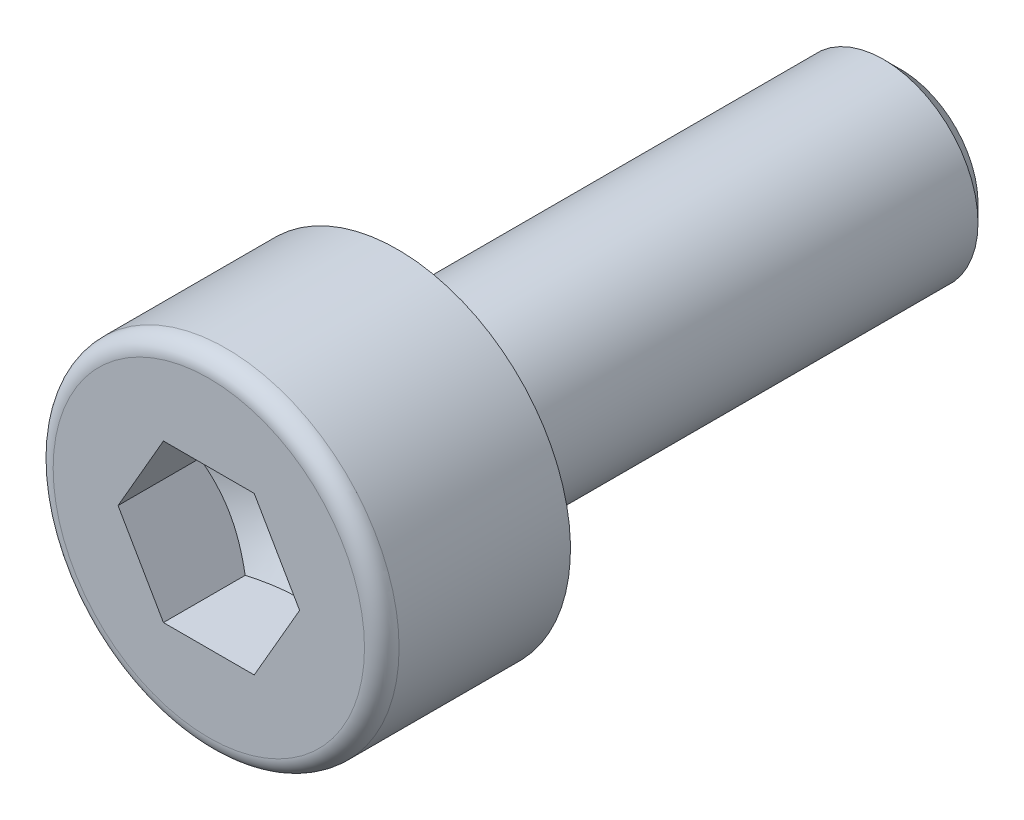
ISO-10303-21;
HEADER;
FILE_DESCRIPTION(('STEP AP214'),'2;1');
FILE_NAME('part.step','',(''),(''),'','','');
FILE_SCHEMA(('AUTOMOTIVE_DESIGN { 1 0 10303 214 1 1 1 1 }'));
ENDSEC;
DATA;
#1=APPLICATION_CONTEXT('core data for automotive mechanical design processes');
#2=APPLICATION_PROTOCOL_DEFINITION('international standard','automotive_design',2000,#1);
#3=PRODUCT_CONTEXT('',#1,'mechanical');
#4=PRODUCT('Part','Part','',(#3));
#5=PRODUCT_RELATED_PRODUCT_CATEGORY('part','',(#4));
#6=PRODUCT_DEFINITION_FORMATION('','',#4);
#7=PRODUCT_DEFINITION_CONTEXT('part definition',#1,'design');
#8=PRODUCT_DEFINITION('design','',#6,#7);
#9=PRODUCT_DEFINITION_SHAPE('','',#8);
#10=(LENGTH_UNIT() NAMED_UNIT(*) SI_UNIT(.MILLI.,.METRE.));
#11=(NAMED_UNIT(*) PLANE_ANGLE_UNIT() SI_UNIT($,.RADIAN.));
#12=(NAMED_UNIT(*) SI_UNIT($,.STERADIAN.) SOLID_ANGLE_UNIT());
#13=UNCERTAINTY_MEASURE_WITH_UNIT(LENGTH_MEASURE(1.E-05),#10,'distance_accuracy_value','');
#14=(GEOMETRIC_REPRESENTATION_CONTEXT(3) GLOBAL_UNCERTAINTY_ASSIGNED_CONTEXT((#13)) GLOBAL_UNIT_ASSIGNED_CONTEXT((#10,
#11,#12)) REPRESENTATION_CONTEXT('',''));
#15=CARTESIAN_POINT('',(0.,0.,0.));
#16=DIRECTION('',(0.,0.,1.));
#17=DIRECTION('',(1.,0.,0.));
#18=AXIS2_PLACEMENT_3D('',#15,#16,#17);
#19=CARTESIAN_POINT('',(0.,1.2375,3.));
#20=DIRECTION('',(0.,0.,1.));
#21=DIRECTION('',(1.,0.,0.));
#22=AXIS2_PLACEMENT_3D('',#19,#20,#21);
#23=PLANE('',#22);
#24=DIRECTION('',(-0.5,0.866025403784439,0.));
#25=VECTOR('',#24,1.);
#26=CARTESIAN_POINT('',(-1.35045785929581,-0.160937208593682,3.));
#27=LINE('',#26,#25);
#28=CARTESIAN_POINT('',(-0.7216875,-1.24999941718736,3.));
#29=VERTEX_POINT('',#28);
#30=CARTESIAN_POINT('',(-1.443375,0.,3.));
#31=VERTEX_POINT('',#30);
#32=EDGE_CURVE('E192',#29,#31,#27,.T.);
#33=ORIENTED_EDGE('',*,*,#32,.T.);
#34=DIRECTION('',(0.5,0.866025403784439,0.));
#35=VECTOR('',#34,1.);
#36=CARTESIAN_POINT('',(-0.81460464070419,1.08906220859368,3.));
#37=LINE('',#36,#35);
#38=CARTESIAN_POINT('',(-0.7216875,1.24999941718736,3.));
#39=VERTEX_POINT('',#38);
#40=EDGE_CURVE('E10',#31,#39,#37,.T.);
#41=ORIENTED_EDGE('',*,*,#40,.T.);
#42=DIRECTION('',(1.,0.,0.));
#43=VECTOR('',#42,1.);
#44=CARTESIAN_POINT('',(0.,1.24999941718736,3.));
#45=LINE('',#44,#43);
#46=CARTESIAN_POINT('',(0.7216875,1.24999941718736,3.));
#47=VERTEX_POINT('',#46);
#48=EDGE_CURVE('E127',#39,#47,#45,.T.);
#49=ORIENTED_EDGE('',*,*,#48,.T.);
#50=DIRECTION('',(0.5,-0.866025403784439,0.));
#51=VECTOR('',#50,1.);
#52=CARTESIAN_POINT('',(0.814604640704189,1.08906220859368,3.));
#53=LINE('',#52,#51);
#54=CARTESIAN_POINT('',(1.443375,0.,3.));
#55=VERTEX_POINT('',#54);
#56=EDGE_CURVE('E185',#47,#55,#53,.T.);
#57=ORIENTED_EDGE('',*,*,#56,.T.);
#58=DIRECTION('',(-0.5,-0.866025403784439,0.));
#59=VECTOR('',#58,1.);
#60=CARTESIAN_POINT('',(1.35045785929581,-0.160937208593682,3.));
#61=LINE('',#60,#59);
#62=CARTESIAN_POINT('',(0.7216875,-1.24999941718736,3.));
#63=VERTEX_POINT('',#62);
#64=EDGE_CURVE('E189',#55,#63,#61,.T.);
#65=ORIENTED_EDGE('',*,*,#64,.T.);
#66=DIRECTION('',(-1.,0.,0.));
#67=VECTOR('',#66,1.);
#68=CARTESIAN_POINT('',(0.,-1.24999941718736,3.));
#69=LINE('',#68,#67);
#70=EDGE_CURVE('E158',#63,#29,#69,.T.);
#71=ORIENTED_EDGE('',*,*,#70,.T.);
#72=EDGE_LOOP('',(#33,#41,#49,#57,#65,#71));
#73=FACE_BOUND('',#72,.T.);
#74=CARTESIAN_POINT('',(0.,0.,3.));
#75=DIRECTION('',(0.,0.,-1.));
#76=DIRECTION('',(0.,1.,0.));
#77=AXIS2_PLACEMENT_3D('',#74,#75,#76);
#78=CIRCLE('',#77,2.475);
#79=CARTESIAN_POINT('',(2.475,0.,3.));
#80=VERTEX_POINT('',#79);
#81=EDGE_CURVE('E150',#80,#80,#78,.T.);
#82=ORIENTED_EDGE('',*,*,#81,.F.);
#83=EDGE_LOOP('',(#82));
#84=FACE_BOUND('',#83,.T.);
#85=ADVANCED_FACE('F16',(#73,#84),#23,.T.);
#86=CARTESIAN_POINT('',(0.,0.6146875,-8.));
#87=DIRECTION('',(0.,0.,-1.));
#88=DIRECTION('',(0.,-1.,0.));
#89=AXIS2_PLACEMENT_3D('',#86,#87,#88);
#90=PLANE('',#89);
#91=CARTESIAN_POINT('',(0.,0.,-8.));
#92=DIRECTION('',(0.,0.,-1.));
#93=DIRECTION('',(0.,1.,0.));
#94=AXIS2_PLACEMENT_3D('',#91,#92,#93);
#95=CIRCLE('',#94,1.229375);
#96=CARTESIAN_POINT('',(0.,-1.229375,-8.));
#97=VERTEX_POINT('',#96);
#98=EDGE_CURVE('E223',#97,#97,#95,.T.);
#99=ORIENTED_EDGE('',*,*,#98,.T.);
#100=EDGE_LOOP('',(#99));
#101=FACE_BOUND('',#100,.T.);
#102=ADVANCED_FACE('F273',(#101),#90,.T.);
#103=CARTESIAN_POINT('',(0.,2.2,0.));
#104=DIRECTION('',(0.,0.,-1.));
#105=DIRECTION('',(0.,-1.,0.));
#106=AXIS2_PLACEMENT_3D('',#103,#104,#105);
#107=PLANE('',#106);
#108=CARTESIAN_POINT('',(0.,0.,0.));
#109=DIRECTION('',(0.,0.,-1.));
#110=DIRECTION('',(0.,1.,0.));
#111=AXIS2_PLACEMENT_3D('',#108,#109,#110);
#112=CIRCLE('',#111,1.65);
#113=CARTESIAN_POINT('',(0.,1.65,0.));
#114=VERTEX_POINT('',#113);
#115=EDGE_CURVE('E156',#114,#114,#112,.T.);
#116=ORIENTED_EDGE('',*,*,#115,.F.);
#117=EDGE_LOOP('',(#116));
#118=FACE_BOUND('',#117,.T.);
#119=CARTESIAN_POINT('',(0.,0.,0.));
#120=DIRECTION('',(0.,0.,-1.));
#121=DIRECTION('',(0.,1.,0.));
#122=AXIS2_PLACEMENT_3D('',#119,#120,#121);
#123=CIRCLE('',#122,2.75);
#124=CARTESIAN_POINT('',(0.,-2.75,0.));
#125=VERTEX_POINT('',#124);
#126=EDGE_CURVE('E225',#125,#125,#123,.T.);
#127=ORIENTED_EDGE('',*,*,#126,.T.);
#128=EDGE_LOOP('',(#127));
#129=FACE_BOUND('',#128,.T.);
#130=ADVANCED_FACE('F277',(#118,#129),#107,.T.);
#131=CARTESIAN_POINT('',(-1.08253125,0.624999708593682,3.));
#132=DIRECTION('',(-0.866025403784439,0.5,0.));
#133=DIRECTION('',(0.,0.,1.));
#134=AXIS2_PLACEMENT_3D('',#131,#132,#133);
#135=PLANE('',#134);
#136=CARTESIAN_POINT('',(-1.443375,0.,1.7));
#137=CARTESIAN_POINT('',(-1.08253125,0.624999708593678,1.49166676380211));
#138=CARTESIAN_POINT('',(-0.7216875,1.24999941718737,1.7));
#139=(BOUNDED_CURVE() B_SPLINE_CURVE(2,(#136,#137,#138),.UNSPECIFIED.,.F.,
.F.) B_SPLINE_CURVE_WITH_KNOTS((3,3),(0.,1.46054449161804),
.UNSPECIFIED.) CURVE() GEOMETRIC_REPRESENTATION_ITEM() RATIONAL_B_SPLINE_CURVE((1.,
1.15470053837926,1.)) REPRESENTATION_ITEM(''));
#140=CARTESIAN_POINT('',(-1.443375,0.,1.7));
#141=VERTEX_POINT('',#140);
#142=CARTESIAN_POINT('',(-0.7216875,1.24999941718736,1.7));
#143=VERTEX_POINT('',#142);
#144=EDGE_CURVE('E132',#141,#143,#139,.T.);
#145=ORIENTED_EDGE('',*,*,#144,.T.);
#146=DIRECTION('',(0.,0.,-1.));
#147=VECTOR('',#146,1.);
#148=CARTESIAN_POINT('',(-0.7216875,1.24999941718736,3.));
#149=LINE('',#148,#147);
#150=EDGE_CURVE('E29',#39,#143,#149,.T.);
#151=ORIENTED_EDGE('',*,*,#150,.F.);
#152=ORIENTED_EDGE('',*,*,#40,.F.);
#153=DIRECTION('',(0.,0.,-1.));
#154=VECTOR('',#153,1.);
#155=CARTESIAN_POINT('',(-1.443375,0.,3.));
#156=LINE('',#155,#154);
#157=EDGE_CURVE('E134',#31,#141,#156,.T.);
#158=ORIENTED_EDGE('',*,*,#157,.T.);
#159=EDGE_LOOP('',(#145,#151,#152,#158));
#160=FACE_BOUND('',#159,.T.);
#161=ADVANCED_FACE('F18',(#160),#135,.F.);
#162=CARTESIAN_POINT('',(0.,1.24999941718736,3.));
#163=DIRECTION('',(0.,1.,0.));
#164=DIRECTION('',(1.,0.,0.));
#165=AXIS2_PLACEMENT_3D('',#162,#163,#164);
#166=PLANE('',#165);
#167=CARTESIAN_POINT('',(-0.7216875,1.24999941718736,1.7));
#168=CARTESIAN_POINT('',(-0.334936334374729,1.24999941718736,1.58835455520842));
#169=CARTESIAN_POINT('',(0.,1.24999941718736,1.58835455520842));
#170=(BOUNDED_CURVE() B_SPLINE_CURVE(2,(#167,#168,#169),.UNSPECIFIED.,.F.,
.F.) B_SPLINE_CURVE_WITH_KNOTS((3,3),(0.,0.730272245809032),
.UNSPECIFIED.) CURVE() GEOMETRIC_REPRESENTATION_ITEM() RATIONAL_B_SPLINE_CURVE((1.,
1.07735026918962,1.07735026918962)) REPRESENTATION_ITEM(''));
#171=CARTESIAN_POINT('',(0.,1.24999941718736,1.58835455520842));
#172=VERTEX_POINT('',#171);
#173=EDGE_CURVE('E124',#143,#172,#170,.T.);
#174=ORIENTED_EDGE('',*,*,#173,.T.);
#175=CARTESIAN_POINT('',(0.,1.24999941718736,1.58835455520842));
#176=CARTESIAN_POINT('',(0.33493633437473,1.24999941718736,1.58835455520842));
#177=CARTESIAN_POINT('',(0.7216875,1.24999941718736,1.7));
#178=(BOUNDED_CURVE() B_SPLINE_CURVE(2,(#175,#176,#177),.UNSPECIFIED.,.F.,
.F.) B_SPLINE_CURVE_WITH_KNOTS((3,3),(0.730272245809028,1.46054449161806),
.UNSPECIFIED.) CURVE() GEOMETRIC_REPRESENTATION_ITEM() RATIONAL_B_SPLINE_CURVE((1.07735026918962,
1.07735026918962,1.)) REPRESENTATION_ITEM(''));
#179=CARTESIAN_POINT('',(0.7216875,1.24999941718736,1.7));
#180=VERTEX_POINT('',#179);
#181=EDGE_CURVE('E143',#172,#180,#178,.T.);
#182=ORIENTED_EDGE('',*,*,#181,.T.);
#183=DIRECTION('',(0.,0.,-1.));
#184=VECTOR('',#183,1.);
#185=CARTESIAN_POINT('',(0.7216875,1.24999941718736,3.));
#186=LINE('',#185,#184);
#187=EDGE_CURVE('E166',#47,#180,#186,.T.);
#188=ORIENTED_EDGE('',*,*,#187,.F.);
#189=ORIENTED_EDGE('',*,*,#48,.F.);
#190=ORIENTED_EDGE('',*,*,#150,.T.);
#191=EDGE_LOOP('',(#174,#182,#188,#189,#190));
#192=FACE_BOUND('',#191,.T.);
#193=ADVANCED_FACE('F121',(#192),#166,.F.);
#194=CARTESIAN_POINT('',(1.08253125,0.624999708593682,3.));
#195=DIRECTION('',(0.866025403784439,0.5,0.));
#196=DIRECTION('',(0.,0.,-1.));
#197=AXIS2_PLACEMENT_3D('',#194,#195,#196);
#198=PLANE('',#197);
#199=CARTESIAN_POINT('',(0.7216875,1.24999941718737,1.7));
#200=CARTESIAN_POINT('',(1.08253125,0.624999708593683,1.49166676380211));
#201=CARTESIAN_POINT('',(1.443375,0.,1.7));
#202=(BOUNDED_CURVE() B_SPLINE_CURVE(2,(#199,#200,#201),.UNSPECIFIED.,.F.,
.F.) B_SPLINE_CURVE_WITH_KNOTS((3,3),(0.,1.46054449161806),
.UNSPECIFIED.) CURVE() GEOMETRIC_REPRESENTATION_ITEM() RATIONAL_B_SPLINE_CURVE((1.,
1.15470053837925,1.)) REPRESENTATION_ITEM(''));
#203=CARTESIAN_POINT('',(1.443375,0.,1.7));
#204=VERTEX_POINT('',#203);
#205=EDGE_CURVE('E179',#180,#204,#202,.T.);
#206=ORIENTED_EDGE('',*,*,#205,.T.);
#207=DIRECTION('',(0.,0.,-1.));
#208=VECTOR('',#207,1.);
#209=CARTESIAN_POINT('',(1.443375,0.,3.));
#210=LINE('',#209,#208);
#211=EDGE_CURVE('E198',#55,#204,#210,.T.);
#212=ORIENTED_EDGE('',*,*,#211,.F.);
#213=ORIENTED_EDGE('',*,*,#56,.F.);
#214=ORIENTED_EDGE('',*,*,#187,.T.);
#215=EDGE_LOOP('',(#206,#212,#213,#214));
#216=FACE_BOUND('',#215,.T.);
#217=ADVANCED_FACE('F244',(#216),#198,.F.);
#218=CARTESIAN_POINT('',(1.08253125,-0.624999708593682,3.));
#219=DIRECTION('',(0.866025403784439,-0.5,0.));
#220=DIRECTION('',(0.,0.,-1.));
#221=AXIS2_PLACEMENT_3D('',#218,#219,#220);
#222=PLANE('',#221);
#223=CARTESIAN_POINT('',(1.443375,0.,1.7));
#224=CARTESIAN_POINT('',(1.08253125,-0.624999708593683,1.49166676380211));
#225=CARTESIAN_POINT('',(0.7216875,-1.24999941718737,1.7));
#226=(BOUNDED_CURVE() B_SPLINE_CURVE(2,(#223,#224,#225),.UNSPECIFIED.,.F.,
.F.) B_SPLINE_CURVE_WITH_KNOTS((3,3),(0.,1.46054449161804),
.UNSPECIFIED.) CURVE() GEOMETRIC_REPRESENTATION_ITEM() RATIONAL_B_SPLINE_CURVE((1.,
1.15470053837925,1.)) REPRESENTATION_ITEM(''));
#227=CARTESIAN_POINT('',(0.7216875,-1.24999941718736,1.7));
#228=VERTEX_POINT('',#227);
#229=EDGE_CURVE('E170',#204,#228,#226,.T.);
#230=ORIENTED_EDGE('',*,*,#229,.T.);
#231=DIRECTION('',(0.,0.,-1.));
#232=VECTOR('',#231,1.);
#233=CARTESIAN_POINT('',(0.7216875,-1.24999941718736,3.));
#234=LINE('',#233,#232);
#235=EDGE_CURVE('E162',#63,#228,#234,.T.);
#236=ORIENTED_EDGE('',*,*,#235,.F.);
#237=ORIENTED_EDGE('',*,*,#64,.F.);
#238=ORIENTED_EDGE('',*,*,#211,.T.);
#239=EDGE_LOOP('',(#230,#236,#237,#238));
#240=FACE_BOUND('',#239,.T.);
#241=ADVANCED_FACE('F250',(#240),#222,.F.);
#242=CARTESIAN_POINT('',(0.,-1.24999941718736,3.));
#243=DIRECTION('',(0.,-1.,0.));
#244=DIRECTION('',(0.,0.,-1.));
#245=AXIS2_PLACEMENT_3D('',#242,#243,#244);
#246=PLANE('',#245);
#247=CARTESIAN_POINT('',(0.7216875,-1.24999941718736,1.7));
#248=CARTESIAN_POINT('',(0.33493633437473,-1.24999941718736,1.58835455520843));
#249=CARTESIAN_POINT('',(0.,-1.24999941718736,1.58835455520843));
#250=(BOUNDED_CURVE() B_SPLINE_CURVE(2,(#247,#248,#249),.UNSPECIFIED.,.F.,
.F.) B_SPLINE_CURVE_WITH_KNOTS((3,3),(0.,0.730272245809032),
.UNSPECIFIED.) CURVE() GEOMETRIC_REPRESENTATION_ITEM() RATIONAL_B_SPLINE_CURVE((1.,
1.07735026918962,1.07735026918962)) REPRESENTATION_ITEM(''));
#251=CARTESIAN_POINT('',(0.,-1.24999941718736,1.58835455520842));
#252=VERTEX_POINT('',#251);
#253=EDGE_CURVE('E20',#228,#252,#250,.T.);
#254=ORIENTED_EDGE('',*,*,#253,.T.);
#255=CARTESIAN_POINT('',(0.,-1.24999941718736,1.58835455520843));
#256=CARTESIAN_POINT('',(-0.33493633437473,-1.24999941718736,1.58835455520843));
#257=CARTESIAN_POINT('',(-0.7216875,-1.24999941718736,1.7));
#258=(BOUNDED_CURVE() B_SPLINE_CURVE(2,(#255,#256,#257),.UNSPECIFIED.,.F.,
.F.) B_SPLINE_CURVE_WITH_KNOTS((3,3),(0.730272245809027,1.46054449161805),
.UNSPECIFIED.) CURVE() GEOMETRIC_REPRESENTATION_ITEM() RATIONAL_B_SPLINE_CURVE((1.07735026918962,
1.07735026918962,1.)) REPRESENTATION_ITEM(''));
#259=CARTESIAN_POINT('',(-0.7216875,-1.24999941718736,1.7));
#260=VERTEX_POINT('',#259);
#261=EDGE_CURVE('E203',#252,#260,#258,.T.);
#262=ORIENTED_EDGE('',*,*,#261,.T.);
#263=DIRECTION('',(0.,0.,-1.));
#264=VECTOR('',#263,1.);
#265=CARTESIAN_POINT('',(-0.7216875,-1.24999941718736,3.));
#266=LINE('',#265,#264);
#267=EDGE_CURVE('E163',#29,#260,#266,.T.);
#268=ORIENTED_EDGE('',*,*,#267,.F.);
#269=ORIENTED_EDGE('',*,*,#70,.F.);
#270=ORIENTED_EDGE('',*,*,#235,.T.);
#271=EDGE_LOOP('',(#254,#262,#268,#269,#270));
#272=FACE_BOUND('',#271,.T.);
#273=ADVANCED_FACE('F254',(#272),#246,.F.);
#274=CARTESIAN_POINT('',(-1.08253125,-0.624999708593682,3.));
#275=DIRECTION('',(-0.866025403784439,-0.5,0.));
#276=DIRECTION('',(-0.5,0.866025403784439,0.));
#277=AXIS2_PLACEMENT_3D('',#274,#275,#276);
#278=PLANE('',#277);
#279=CARTESIAN_POINT('',(-0.7216875,-1.24999941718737,1.7));
#280=CARTESIAN_POINT('',(-1.08253125,-0.624999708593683,1.49166676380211));
#281=CARTESIAN_POINT('',(-1.443375,0.,1.7));
#282=(BOUNDED_CURVE() B_SPLINE_CURVE(2,(#279,#280,#281),.UNSPECIFIED.,.F.,
.F.) B_SPLINE_CURVE_WITH_KNOTS((3,3),(0.,1.46054449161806),
.UNSPECIFIED.) CURVE() GEOMETRIC_REPRESENTATION_ITEM() RATIONAL_B_SPLINE_CURVE((1.,
1.15470053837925,1.)) REPRESENTATION_ITEM(''));
#283=EDGE_CURVE('E139',#260,#141,#282,.T.);
#284=ORIENTED_EDGE('',*,*,#283,.T.);
#285=ORIENTED_EDGE('',*,*,#157,.F.);
#286=ORIENTED_EDGE('',*,*,#32,.F.);
#287=ORIENTED_EDGE('',*,*,#267,.T.);
#288=EDGE_LOOP('',(#284,#285,#286,#287));
#289=FACE_BOUND('',#288,.T.);
#290=ADVANCED_FACE('F258',(#289),#278,.F.);
#291=CARTESIAN_POINT('',(0.,0.,1.28333352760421));
#292=DIRECTION('',(0.,0.,1.));
#293=DIRECTION('',(0.,1.,0.));
#294=AXIS2_PLACEMENT_3D('',#291,#292,#293);
#295=CONICAL_SURFACE('',#294,0.7216875,1.0471975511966);
#296=CARTESIAN_POINT('',(0.,0.,0.866667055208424));
#297=VERTEX_POINT('',#296);
#298=VERTEX_LOOP('',#297);
#299=FACE_BOUND('',#298,.T.);
#300=ORIENTED_EDGE('',*,*,#181,.F.);
#301=ORIENTED_EDGE('',*,*,#173,.F.);
#302=ORIENTED_EDGE('',*,*,#144,.F.);
#303=ORIENTED_EDGE('',*,*,#283,.F.);
#304=ORIENTED_EDGE('',*,*,#261,.F.);
#305=ORIENTED_EDGE('',*,*,#253,.F.);
#306=ORIENTED_EDGE('',*,*,#229,.F.);
#307=ORIENTED_EDGE('',*,*,#205,.F.);
#308=EDGE_LOOP('',(#300,#301,#302,#303,#304,#305,#306,#307));
#309=FACE_BOUND('',#308,.T.);
#310=ADVANCED_FACE('F141',(#299,#309),#295,.F.);
#311=CARTESIAN_POINT('',(0.,0.,2.725));
#312=DIRECTION('',(0.,0.,-1.));
#313=DIRECTION('',(-1.,0.,0.));
#314=AXIS2_PLACEMENT_3D('',#311,#312,#313);
#315=TOROIDAL_SURFACE('',#314,2.475,0.275);
#316=ORIENTED_EDGE('',*,*,#81,.T.);
#317=EDGE_LOOP('',(#316));
#318=FACE_BOUND('',#317,.T.);
#319=CARTESIAN_POINT('',(0.,0.,2.725));
#320=DIRECTION('',(0.,0.,-1.));
#321=DIRECTION('',(0.,1.,0.));
#322=AXIS2_PLACEMENT_3D('',#319,#320,#321);
#323=CIRCLE('',#322,2.75);
#324=CARTESIAN_POINT('',(-2.75,0.,2.725));
#325=VERTEX_POINT('',#324);
#326=EDGE_CURVE('E195',#325,#325,#323,.T.);
#327=ORIENTED_EDGE('',*,*,#326,.F.);
#328=EDGE_LOOP('',(#327));
#329=FACE_BOUND('',#328,.T.);
#330=ADVANCED_FACE('F266',(#318,#329),#315,.T.);
#331=CARTESIAN_POINT('',(0.,0.,1.3625));
#332=DIRECTION('',(0.,0.,-1.));
#333=DIRECTION('',(0.,1.,0.));
#334=AXIS2_PLACEMENT_3D('',#331,#332,#333);
#335=CYLINDRICAL_SURFACE('',#334,2.75);
#336=ORIENTED_EDGE('',*,*,#326,.T.);
#337=EDGE_LOOP('',(#336));
#338=FACE_BOUND('',#337,.T.);
#339=ORIENTED_EDGE('',*,*,#126,.F.);
#340=EDGE_LOOP('',(#339));
#341=FACE_BOUND('',#340,.T.);
#342=ADVANCED_FACE('F283',(#338,#341),#335,.T.);
#343=CARTESIAN_POINT('',(0.,0.,-0.15));
#344=DIRECTION('',(0.,0.,-1.));
#345=DIRECTION('',(-1.,0.,0.));
#346=AXIS2_PLACEMENT_3D('',#343,#344,#345);
#347=TOROIDAL_SURFACE('',#346,1.65,0.15);
#348=ORIENTED_EDGE('',*,*,#115,.T.);
#349=EDGE_LOOP('',(#348));
#350=FACE_BOUND('',#349,.T.);
#351=CARTESIAN_POINT('',(0.,0.,-0.15));
#352=DIRECTION('',(0.,0.,-1.));
#353=DIRECTION('',(0.,1.,0.));
#354=AXIS2_PLACEMENT_3D('',#351,#352,#353);
#355=CIRCLE('',#354,1.5);
#356=CARTESIAN_POINT('',(-1.5,0.,-0.15));
#357=VERTEX_POINT('',#356);
#358=EDGE_CURVE('E393',#357,#357,#355,.T.);
#359=ORIENTED_EDGE('',*,*,#358,.F.);
#360=EDGE_LOOP('',(#359));
#361=FACE_BOUND('',#360,.T.);
#362=ADVANCED_FACE('F285',(#350,#361),#347,.F.);
#363=CARTESIAN_POINT('',(0.,0.,-3.9396875));
#364=DIRECTION('',(0.,0.,-1.));
#365=DIRECTION('',(0.,1.,0.));
#366=AXIS2_PLACEMENT_3D('',#363,#364,#365);
#367=CYLINDRICAL_SURFACE('',#366,1.5);
#368=ORIENTED_EDGE('',*,*,#358,.T.);
#369=EDGE_LOOP('',(#368));
#370=FACE_BOUND('',#369,.T.);
#371=CARTESIAN_POINT('',(0.,0.,-7.729375));
#372=DIRECTION('',(0.,0.,-1.));
#373=DIRECTION('',(0.,1.,0.));
#374=AXIS2_PLACEMENT_3D('',#371,#372,#373);
#375=CIRCLE('',#374,1.5);
#376=CARTESIAN_POINT('',(0.,-1.5,-7.729375));
#377=VERTEX_POINT('',#376);
#378=EDGE_CURVE('E389',#377,#377,#375,.T.);
#379=ORIENTED_EDGE('',*,*,#378,.F.);
#380=EDGE_LOOP('',(#379));
#381=FACE_BOUND('',#380,.T.);
#382=ADVANCED_FACE('F291',(#370,#381),#367,.T.);
#383=CARTESIAN_POINT('',(0.,0.,-7.8646875));
#384=DIRECTION('',(0.,0.,1.));
#385=DIRECTION('',(0.,1.,0.));
#386=AXIS2_PLACEMENT_3D('',#383,#384,#385);
#387=CONICAL_SURFACE('',#386,1.3646875,0.78539816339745);
#388=ORIENTED_EDGE('',*,*,#378,.T.);
#389=EDGE_LOOP('',(#388));
#390=FACE_BOUND('',#389,.T.);
#391=ORIENTED_EDGE('',*,*,#98,.F.);
#392=EDGE_LOOP('',(#391));
#393=FACE_BOUND('',#392,.T.);
#394=ADVANCED_FACE('F294',(#390,#393),#387,.T.);
#395=CLOSED_SHELL('',(#85,#102,#130,#161,#193,#217,#241,#273,#290,#310,#330,#342,#362,#382,#394));
#396=MANIFOLD_SOLID_BREP('B1',#395);
#397=ADVANCED_BREP_SHAPE_REPRESENTATION('',(#18,#396),#14);
#398=SHAPE_DEFINITION_REPRESENTATION(#9,#397);
ENDSEC;
END-ISO-10303-21;
